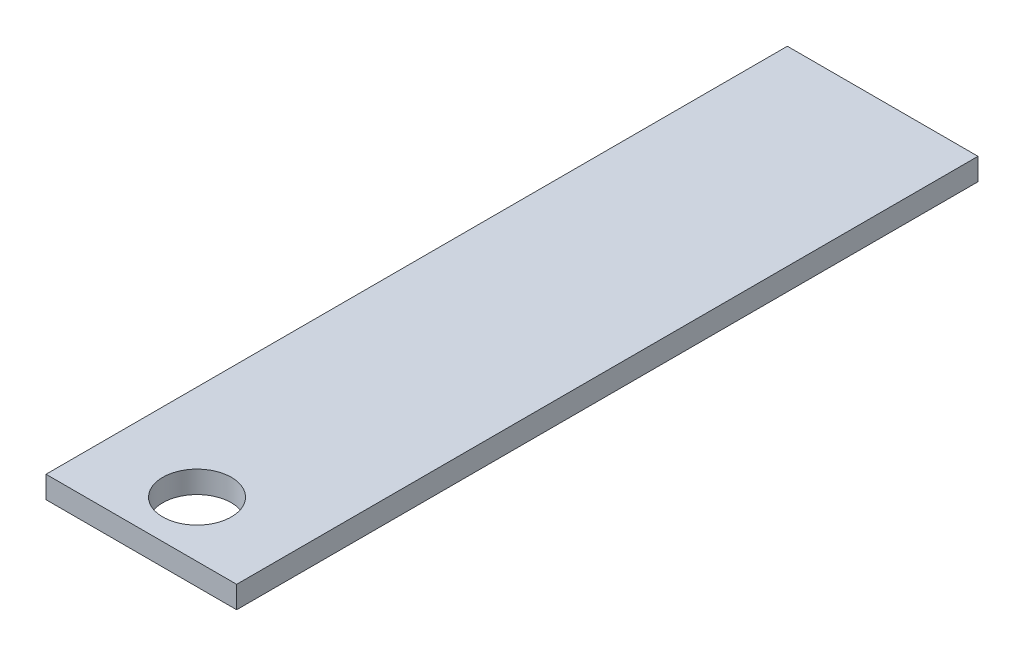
ISO-10303-21;
HEADER;
FILE_DESCRIPTION(('STEP AP214'),'2;1');
FILE_NAME('part.step','',(''),(''),'','','');
FILE_SCHEMA(('AUTOMOTIVE_DESIGN { 1 0 10303 214 1 1 1 1 }'));
ENDSEC;
DATA;
#1=APPLICATION_CONTEXT('core data for automotive mechanical design processes');
#2=APPLICATION_PROTOCOL_DEFINITION('international standard','automotive_design',2000,#1);
#3=PRODUCT_CONTEXT('',#1,'mechanical');
#4=PRODUCT('Part','Part','',(#3));
#5=PRODUCT_RELATED_PRODUCT_CATEGORY('part','',(#4));
#6=PRODUCT_DEFINITION_FORMATION('','',#4);
#7=PRODUCT_DEFINITION_CONTEXT('part definition',#1,'design');
#8=PRODUCT_DEFINITION('design','',#6,#7);
#9=PRODUCT_DEFINITION_SHAPE('','',#8);
#10=(LENGTH_UNIT() NAMED_UNIT(*) SI_UNIT(.MILLI.,.METRE.));
#11=(NAMED_UNIT(*) PLANE_ANGLE_UNIT() SI_UNIT($,.RADIAN.));
#12=(NAMED_UNIT(*) SI_UNIT($,.STERADIAN.) SOLID_ANGLE_UNIT());
#13=UNCERTAINTY_MEASURE_WITH_UNIT(LENGTH_MEASURE(1.E-05),#10,'distance_accuracy_value','');
#14=(GEOMETRIC_REPRESENTATION_CONTEXT(3) GLOBAL_UNCERTAINTY_ASSIGNED_CONTEXT((#13)) GLOBAL_UNIT_ASSIGNED_CONTEXT((#10,
#11,#12)) REPRESENTATION_CONTEXT('',''));
#15=CARTESIAN_POINT('',(0.,0.,0.));
#16=DIRECTION('',(0.,0.,1.));
#17=DIRECTION('',(1.,0.,0.));
#18=AXIS2_PLACEMENT_3D('',#15,#16,#17);
#19=CARTESIAN_POINT('',(-30.861,-3.571875,120.000000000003));
#20=DIRECTION('',(1.,0.,0.));
#21=DIRECTION('',(0.,0.,-1.));
#22=AXIS2_PLACEMENT_3D('',#19,#20,#21);
#23=PLANE('',#22);
#24=DIRECTION('',(0.,-1.,0.));
#25=VECTOR('',#24,1.);
#26=CARTESIAN_POINT('',(-30.861,-3.571875,-120.000000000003));
#27=LINE('',#26,#25);
#28=CARTESIAN_POINT('',(-30.861,3.571875,-120.000000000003));
#29=VERTEX_POINT('',#28);
#30=CARTESIAN_POINT('',(-30.861,-3.571875,-120.000000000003));
#31=VERTEX_POINT('',#30);
#32=EDGE_CURVE('E111',#29,#31,#27,.T.);
#33=ORIENTED_EDGE('',*,*,#32,.T.);
#34=DIRECTION('',(0.,0.,-1.));
#35=VECTOR('',#34,1.);
#36=CARTESIAN_POINT('',(-30.861,-3.571875,120.000000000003));
#37=LINE('',#36,#35);
#38=CARTESIAN_POINT('',(-30.861,-3.571875,120.000000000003));
#39=VERTEX_POINT('',#38);
#40=EDGE_CURVE('E11',#39,#31,#37,.T.);
#41=ORIENTED_EDGE('',*,*,#40,.F.);
#42=DIRECTION('',(0.,-1.,0.));
#43=VECTOR('',#42,1.);
#44=CARTESIAN_POINT('',(-30.861,-3.571875,120.000000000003));
#45=LINE('',#44,#43);
#46=CARTESIAN_POINT('',(-30.861,3.571875,120.000000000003));
#47=VERTEX_POINT('',#46);
#48=EDGE_CURVE('E95',#47,#39,#45,.T.);
#49=ORIENTED_EDGE('',*,*,#48,.F.);
#50=DIRECTION('',(0.,0.,-1.));
#51=VECTOR('',#50,1.);
#52=CARTESIAN_POINT('',(-30.861,3.571875,120.000000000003));
#53=LINE('',#52,#51);
#54=EDGE_CURVE('E107',#47,#29,#53,.T.);
#55=ORIENTED_EDGE('',*,*,#54,.T.);
#56=EDGE_LOOP('',(#33,#41,#49,#55));
#57=FACE_BOUND('',#56,.T.);
#58=ADVANCED_FACE('F43',(#57),#23,.F.);
#59=CARTESIAN_POINT('',(30.861,-3.571875,120.000000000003));
#60=DIRECTION('',(0.,1.,0.));
#61=DIRECTION('',(0.,0.,1.));
#62=AXIS2_PLACEMENT_3D('',#59,#60,#61);
#63=PLANE('',#62);
#64=CARTESIAN_POINT('',(0.,-3.571875,101.966000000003));
#65=DIRECTION('',(0.,-1.,0.));
#66=DIRECTION('',(0.,0.,-1.));
#67=AXIS2_PLACEMENT_3D('',#64,#65,#66);
#68=CIRCLE('',#67,11.1125);
#69=CARTESIAN_POINT('',(0.,-3.571875,90.8535000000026));
#70=VERTEX_POINT('',#69);
#71=EDGE_CURVE('E135',#70,#70,#68,.T.);
#72=ORIENTED_EDGE('',*,*,#71,.F.);
#73=EDGE_LOOP('',(#72));
#74=FACE_BOUND('',#73,.T.);
#75=DIRECTION('',(1.,0.,0.));
#76=VECTOR('',#75,1.);
#77=CARTESIAN_POINT('',(30.861,-3.571875,-120.000000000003));
#78=LINE('',#77,#76);
#79=CARTESIAN_POINT('',(30.861,-3.571875,-120.000000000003));
#80=VERTEX_POINT('',#79);
#81=EDGE_CURVE('E100',#31,#80,#78,.T.);
#82=ORIENTED_EDGE('',*,*,#81,.T.);
#83=DIRECTION('',(0.,0.,-1.));
#84=VECTOR('',#83,1.);
#85=CARTESIAN_POINT('',(30.861,-3.571875,120.000000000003));
#86=LINE('',#85,#84);
#87=CARTESIAN_POINT('',(30.861,-3.571875,120.000000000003));
#88=VERTEX_POINT('',#87);
#89=EDGE_CURVE('E52',#88,#80,#86,.T.);
#90=ORIENTED_EDGE('',*,*,#89,.F.);
#91=DIRECTION('',(1.,0.,0.));
#92=VECTOR('',#91,1.);
#93=CARTESIAN_POINT('',(30.861,-3.571875,120.000000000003));
#94=LINE('',#93,#92);
#95=EDGE_CURVE('E90',#39,#88,#94,.T.);
#96=ORIENTED_EDGE('',*,*,#95,.F.);
#97=ORIENTED_EDGE('',*,*,#40,.T.);
#98=EDGE_LOOP('',(#82,#90,#96,#97));
#99=FACE_BOUND('',#98,.T.);
#100=ADVANCED_FACE('F99',(#74,#99),#63,.F.);
#101=CARTESIAN_POINT('',(30.861,3.571875,120.000000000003));
#102=DIRECTION('',(-1.,0.,0.));
#103=DIRECTION('',(0.,0.,1.));
#104=AXIS2_PLACEMENT_3D('',#101,#102,#103);
#105=PLANE('',#104);
#106=DIRECTION('',(0.,1.,0.));
#107=VECTOR('',#106,1.);
#108=CARTESIAN_POINT('',(30.861,3.571875,-120.000000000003));
#109=LINE('',#108,#107);
#110=CARTESIAN_POINT('',(30.861,3.571875,-120.000000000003));
#111=VERTEX_POINT('',#110);
#112=EDGE_CURVE('E77',#80,#111,#109,.T.);
#113=ORIENTED_EDGE('',*,*,#112,.T.);
#114=DIRECTION('',(0.,0.,-1.));
#115=VECTOR('',#114,1.);
#116=CARTESIAN_POINT('',(30.861,3.571875,120.000000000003));
#117=LINE('',#116,#115);
#118=CARTESIAN_POINT('',(30.861,3.571875,120.000000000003));
#119=VERTEX_POINT('',#118);
#120=EDGE_CURVE('E102',#119,#111,#117,.T.);
#121=ORIENTED_EDGE('',*,*,#120,.F.);
#122=DIRECTION('',(0.,1.,0.));
#123=VECTOR('',#122,1.);
#124=CARTESIAN_POINT('',(30.861,3.571875,120.000000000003));
#125=LINE('',#124,#123);
#126=EDGE_CURVE('E93',#88,#119,#125,.T.);
#127=ORIENTED_EDGE('',*,*,#126,.F.);
#128=ORIENTED_EDGE('',*,*,#89,.T.);
#129=EDGE_LOOP('',(#113,#121,#127,#128));
#130=FACE_BOUND('',#129,.T.);
#131=ADVANCED_FACE('F103',(#130),#105,.F.);
#132=CARTESIAN_POINT('',(-30.861,3.571875,120.000000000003));
#133=DIRECTION('',(0.,-1.,0.));
#134=DIRECTION('',(0.,0.,-1.));
#135=AXIS2_PLACEMENT_3D('',#132,#133,#134);
#136=PLANE('',#135);
#137=CARTESIAN_POINT('',(0.,3.571875,101.966000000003));
#138=DIRECTION('',(0.,-1.,0.));
#139=DIRECTION('',(0.,0.,-1.));
#140=AXIS2_PLACEMENT_3D('',#137,#138,#139);
#141=CIRCLE('',#140,11.1125);
#142=CARTESIAN_POINT('',(0.,3.571875,90.8535000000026));
#143=VERTEX_POINT('',#142);
#144=EDGE_CURVE('E115',#143,#143,#141,.F.);
#145=ORIENTED_EDGE('',*,*,#144,.F.);
#146=EDGE_LOOP('',(#145));
#147=FACE_BOUND('',#146,.T.);
#148=DIRECTION('',(-1.,0.,0.));
#149=VECTOR('',#148,1.);
#150=CARTESIAN_POINT('',(-30.861,3.571875,-120.000000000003));
#151=LINE('',#150,#149);
#152=EDGE_CURVE('E83',#111,#29,#151,.T.);
#153=ORIENTED_EDGE('',*,*,#152,.T.);
#154=ORIENTED_EDGE('',*,*,#54,.F.);
#155=DIRECTION('',(-1.,0.,0.));
#156=VECTOR('',#155,1.);
#157=CARTESIAN_POINT('',(-30.861,3.571875,120.000000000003));
#158=LINE('',#157,#156);
#159=EDGE_CURVE('E60',#119,#47,#158,.T.);
#160=ORIENTED_EDGE('',*,*,#159,.F.);
#161=ORIENTED_EDGE('',*,*,#120,.T.);
#162=EDGE_LOOP('',(#153,#154,#160,#161));
#163=FACE_BOUND('',#162,.T.);
#164=ADVANCED_FACE('F125',(#147,#163),#136,.F.);
#165=CARTESIAN_POINT('',(0.,0.,120.000000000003));
#166=DIRECTION('',(0.,0.,-1.));
#167=DIRECTION('',(-1.,0.,0.));
#168=AXIS2_PLACEMENT_3D('',#165,#166,#167);
#169=PLANE('',#168);
#170=ORIENTED_EDGE('',*,*,#48,.T.);
#171=ORIENTED_EDGE('',*,*,#95,.T.);
#172=ORIENTED_EDGE('',*,*,#126,.T.);
#173=ORIENTED_EDGE('',*,*,#159,.T.);
#174=EDGE_LOOP('',(#170,#171,#172,#173));
#175=FACE_BOUND('',#174,.T.);
#176=ADVANCED_FACE('F91',(#175),#169,.F.);
#177=CARTESIAN_POINT('',(0.,0.,-120.000000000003));
#178=DIRECTION('',(0.,0.,-1.));
#179=DIRECTION('',(-1.,0.,0.));
#180=AXIS2_PLACEMENT_3D('',#177,#178,#179);
#181=PLANE('',#180);
#182=ORIENTED_EDGE('',*,*,#32,.F.);
#183=ORIENTED_EDGE('',*,*,#152,.F.);
#184=ORIENTED_EDGE('',*,*,#112,.F.);
#185=ORIENTED_EDGE('',*,*,#81,.F.);
#186=EDGE_LOOP('',(#182,#183,#184,#185));
#187=FACE_BOUND('',#186,.T.);
#188=ADVANCED_FACE('F128',(#187),#181,.T.);
#189=CARTESIAN_POINT('',(0.,3.572875,101.966000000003));
#190=DIRECTION('',(0.,-1.,0.));
#191=DIRECTION('',(0.,0.,-1.));
#192=AXIS2_PLACEMENT_3D('',#189,#190,#191);
#193=CYLINDRICAL_SURFACE('',#192,11.1125);
#194=ORIENTED_EDGE('',*,*,#71,.T.);
#195=EDGE_LOOP('',(#194));
#196=FACE_BOUND('',#195,.T.);
#197=ORIENTED_EDGE('',*,*,#144,.T.);
#198=EDGE_LOOP('',(#197));
#199=FACE_BOUND('',#198,.T.);
#200=ADVANCED_FACE('F140',(#196,#199),#193,.F.);
#201=CLOSED_SHELL('',(#58,#100,#131,#164,#176,#188,#200));
#202=MANIFOLD_SOLID_BREP('B2',#201);
#203=ADVANCED_BREP_SHAPE_REPRESENTATION('',(#18,#202),#14);
#204=SHAPE_DEFINITION_REPRESENTATION(#9,#203);
ENDSEC;
END-ISO-10303-21;
